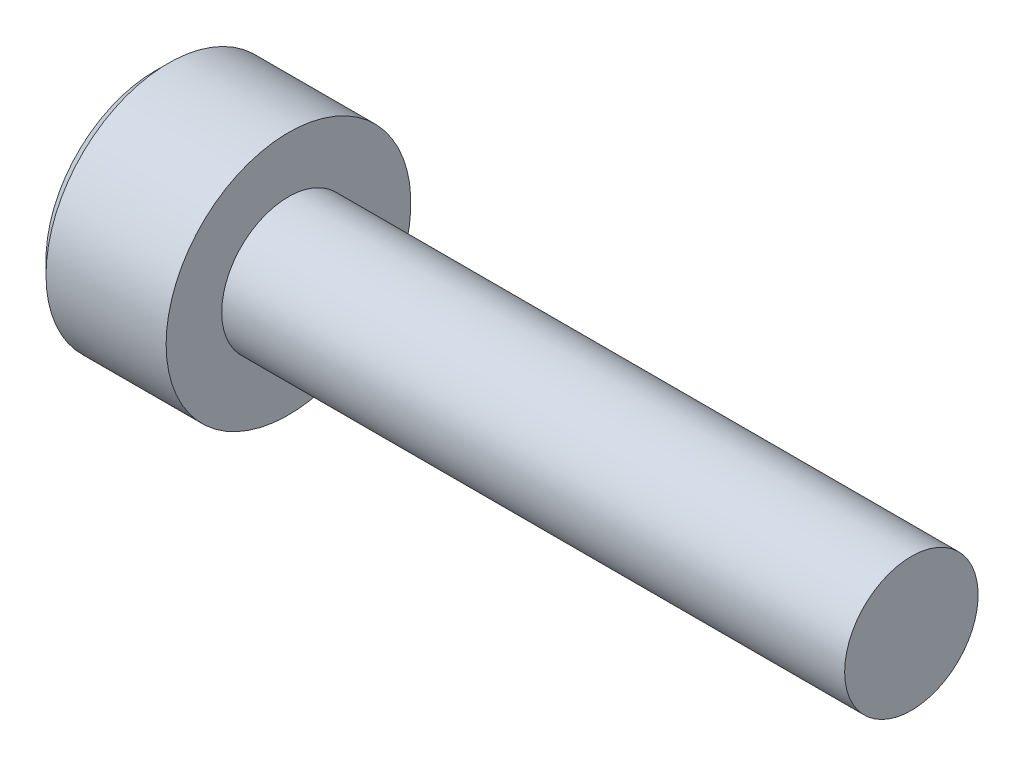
ISO-10303-21;
HEADER;
FILE_DESCRIPTION(('STEP AP214'),'2;1');
FILE_NAME('part.step','',(''),(''),'','','');
FILE_SCHEMA(('AUTOMOTIVE_DESIGN { 1 0 10303 214 1 1 1 1 }'));
ENDSEC;
DATA;
#1=APPLICATION_CONTEXT('core data for automotive mechanical design processes');
#2=APPLICATION_PROTOCOL_DEFINITION('international standard','automotive_design',2000,#1);
#3=PRODUCT_CONTEXT('',#1,'mechanical');
#4=PRODUCT('Part','Part','',(#3));
#5=PRODUCT_RELATED_PRODUCT_CATEGORY('part','',(#4));
#6=PRODUCT_DEFINITION_FORMATION('','',#4);
#7=PRODUCT_DEFINITION_CONTEXT('part definition',#1,'design');
#8=PRODUCT_DEFINITION('design','',#6,#7);
#9=PRODUCT_DEFINITION_SHAPE('','',#8);
#10=(LENGTH_UNIT() NAMED_UNIT(*) SI_UNIT(.MILLI.,.METRE.));
#11=(NAMED_UNIT(*) PLANE_ANGLE_UNIT() SI_UNIT($,.RADIAN.));
#12=(NAMED_UNIT(*) SI_UNIT($,.STERADIAN.) SOLID_ANGLE_UNIT());
#13=UNCERTAINTY_MEASURE_WITH_UNIT(LENGTH_MEASURE(1.E-05),#10,'distance_accuracy_value','');
#14=(GEOMETRIC_REPRESENTATION_CONTEXT(3) GLOBAL_UNCERTAINTY_ASSIGNED_CONTEXT((#13)) GLOBAL_UNIT_ASSIGNED_CONTEXT((#10,
#11,#12)) REPRESENTATION_CONTEXT('',''));
#15=CARTESIAN_POINT('',(0.,0.,0.));
#16=DIRECTION('',(0.,0.,1.));
#17=DIRECTION('',(1.,0.,0.));
#18=AXIS2_PLACEMENT_3D('',#15,#16,#17);
#19=CARTESIAN_POINT('',(-3.,2.75,0.));
#20=DIRECTION('',(1.,0.,0.));
#21=DIRECTION('',(0.,0.,-1.));
#22=AXIS2_PLACEMENT_3D('',#19,#20,#21);
#23=PLANE('',#22);
#24=CARTESIAN_POINT('',(-3.,0.,0.));
#25=DIRECTION('',(1.,0.,0.));
#26=DIRECTION('',(0.,0.,-1.));
#27=AXIS2_PLACEMENT_3D('',#24,#25,#26);
#28=CIRCLE('',#27,2.45);
#29=CARTESIAN_POINT('',(-3.,0.,-2.45));
#30=VERTEX_POINT('',#29);
#31=EDGE_CURVE('E45',#30,#30,#28,.F.);
#32=ORIENTED_EDGE('',*,*,#31,.T.);
#33=EDGE_LOOP('',(#32));
#34=FACE_BOUND('',#33,.T.);
#35=DIRECTION('',(0.,0.5,0.866025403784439));
#36=VECTOR('',#35,1.);
#37=CARTESIAN_POINT('',(-3.,-1.44337567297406,0.));
#38=LINE('',#37,#36);
#39=CARTESIAN_POINT('',(-3.,-1.44337567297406,0.));
#40=VERTEX_POINT('',#39);
#41=CARTESIAN_POINT('',(-3.,-0.721687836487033,1.25));
#42=VERTEX_POINT('',#41);
#43=EDGE_CURVE('E152',#40,#42,#38,.T.);
#44=ORIENTED_EDGE('',*,*,#43,.F.);
#45=DIRECTION('',(0.,-0.5,0.866025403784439));
#46=VECTOR('',#45,1.);
#47=CARTESIAN_POINT('',(-3.,-0.721687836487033,-1.25));
#48=LINE('',#47,#46);
#49=CARTESIAN_POINT('',(-3.,-0.721687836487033,-1.25));
#50=VERTEX_POINT('',#49);
#51=EDGE_CURVE('E52',#50,#40,#48,.T.);
#52=ORIENTED_EDGE('',*,*,#51,.F.);
#53=DIRECTION('',(0.,-1.,0.));
#54=VECTOR('',#53,1.);
#55=CARTESIAN_POINT('',(-3.,0.721687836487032,-1.25));
#56=LINE('',#55,#54);
#57=CARTESIAN_POINT('',(-3.,0.721687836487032,-1.25));
#58=VERTEX_POINT('',#57);
#59=EDGE_CURVE('E122',#58,#50,#56,.T.);
#60=ORIENTED_EDGE('',*,*,#59,.F.);
#61=DIRECTION('',(0.,-0.5,-0.866025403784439));
#62=VECTOR('',#61,1.);
#63=CARTESIAN_POINT('',(-3.,1.44337567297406,0.));
#64=LINE('',#63,#62);
#65=CARTESIAN_POINT('',(-3.,1.44337567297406,0.));
#66=VERTEX_POINT('',#65);
#67=EDGE_CURVE('E158',#66,#58,#64,.T.);
#68=ORIENTED_EDGE('',*,*,#67,.F.);
#69=DIRECTION('',(0.,0.5,-0.866025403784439));
#70=VECTOR('',#69,1.);
#71=CARTESIAN_POINT('',(-3.,0.721687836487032,1.25));
#72=LINE('',#71,#70);
#73=CARTESIAN_POINT('',(-3.,0.721687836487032,1.25));
#74=VERTEX_POINT('',#73);
#75=EDGE_CURVE('E156',#74,#66,#72,.T.);
#76=ORIENTED_EDGE('',*,*,#75,.F.);
#77=DIRECTION('',(0.,1.,0.));
#78=VECTOR('',#77,1.);
#79=CARTESIAN_POINT('',(-3.,-0.721687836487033,1.25));
#80=LINE('',#79,#78);
#81=EDGE_CURVE('E154',#42,#74,#80,.T.);
#82=ORIENTED_EDGE('',*,*,#81,.F.);
#83=EDGE_LOOP('',(#44,#52,#60,#68,#76,#82));
#84=FACE_BOUND('',#83,.T.);
#85=ADVANCED_FACE('F37',(#34,#84),#23,.F.);
#86=CARTESIAN_POINT('',(14.,0.,0.));
#87=DIRECTION('',(-1.,0.,0.));
#88=DIRECTION('',(0.,0.,1.));
#89=AXIS2_PLACEMENT_3D('',#86,#87,#88);
#90=PLANE('',#89);
#91=CARTESIAN_POINT('',(14.,0.,0.));
#92=DIRECTION('',(-1.,0.,0.));
#93=DIRECTION('',(0.,0.,1.));
#94=AXIS2_PLACEMENT_3D('',#91,#92,#93);
#95=CIRCLE('',#94,1.5);
#96=CARTESIAN_POINT('',(14.,0.,1.5));
#97=VERTEX_POINT('',#96);
#98=EDGE_CURVE('E184',#97,#97,#95,.T.);
#99=ORIENTED_EDGE('',*,*,#98,.F.);
#100=EDGE_LOOP('',(#99));
#101=FACE_BOUND('',#100,.T.);
#102=ADVANCED_FACE('F205',(#101),#90,.F.);
#103=CARTESIAN_POINT('',(-3.,0.,0.));
#104=DIRECTION('',(-1.,0.,0.));
#105=DIRECTION('',(0.,0.,1.));
#106=AXIS2_PLACEMENT_3D('',#103,#104,#105);
#107=CYLINDRICAL_SURFACE('',#106,1.5);
#108=CARTESIAN_POINT('',(0.,0.,0.));
#109=DIRECTION('',(-1.,0.,0.));
#110=DIRECTION('',(0.,0.,1.));
#111=AXIS2_PLACEMENT_3D('',#108,#109,#110);
#112=CIRCLE('',#111,1.5);
#113=CARTESIAN_POINT('',(0.,0.,1.5));
#114=VERTEX_POINT('',#113);
#115=EDGE_CURVE('E181',#114,#114,#112,.T.);
#116=ORIENTED_EDGE('',*,*,#115,.F.);
#117=EDGE_LOOP('',(#116));
#118=FACE_BOUND('',#117,.T.);
#119=ORIENTED_EDGE('',*,*,#98,.T.);
#120=EDGE_LOOP('',(#119));
#121=FACE_BOUND('',#120,.T.);
#122=ADVANCED_FACE('F209',(#118,#121),#107,.T.);
#123=CARTESIAN_POINT('',(0.,1.5,0.));
#124=DIRECTION('',(-1.,0.,0.));
#125=DIRECTION('',(0.,0.,1.));
#126=AXIS2_PLACEMENT_3D('',#123,#124,#125);
#127=PLANE('',#126);
#128=CARTESIAN_POINT('',(0.,0.,0.));
#129=DIRECTION('',(-1.,0.,0.));
#130=DIRECTION('',(0.,0.,1.));
#131=AXIS2_PLACEMENT_3D('',#128,#129,#130);
#132=CIRCLE('',#131,2.75);
#133=CARTESIAN_POINT('',(0.,0.,2.75));
#134=VERTEX_POINT('',#133);
#135=EDGE_CURVE('E177',#134,#134,#132,.T.);
#136=ORIENTED_EDGE('',*,*,#135,.F.);
#137=EDGE_LOOP('',(#136));
#138=FACE_BOUND('',#137,.T.);
#139=ORIENTED_EDGE('',*,*,#115,.T.);
#140=EDGE_LOOP('',(#139));
#141=FACE_BOUND('',#140,.T.);
#142=ADVANCED_FACE('F200',(#138,#141),#127,.F.);
#143=CARTESIAN_POINT('',(-3.,0.,0.));
#144=DIRECTION('',(-1.,0.,0.));
#145=DIRECTION('',(0.,0.,1.));
#146=AXIS2_PLACEMENT_3D('',#143,#144,#145);
#147=CYLINDRICAL_SURFACE('',#146,2.75);
#148=CARTESIAN_POINT('',(-2.7,0.,0.));
#149=DIRECTION('',(1.,0.,0.));
#150=DIRECTION('',(0.,0.,-1.));
#151=AXIS2_PLACEMENT_3D('',#148,#149,#150);
#152=CIRCLE('',#151,2.75);
#153=CARTESIAN_POINT('',(-2.7,0.,-2.75));
#154=VERTEX_POINT('',#153);
#155=EDGE_CURVE('E11',#154,#154,#152,.T.);
#156=ORIENTED_EDGE('',*,*,#155,.T.);
#157=EDGE_LOOP('',(#156));
#158=FACE_BOUND('',#157,.T.);
#159=ORIENTED_EDGE('',*,*,#135,.T.);
#160=EDGE_LOOP('',(#159));
#161=FACE_BOUND('',#160,.T.);
#162=ADVANCED_FACE('F192',(#158,#161),#147,.T.);
#163=CARTESIAN_POINT('',(-3.,0.,0.));
#164=DIRECTION('',(1.,0.,0.));
#165=DIRECTION('',(0.,0.,-1.));
#166=AXIS2_PLACEMENT_3D('',#163,#164,#165);
#167=CONICAL_SURFACE('',#166,2.45,0.785398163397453);
#168=ORIENTED_EDGE('',*,*,#155,.F.);
#169=EDGE_LOOP('',(#168));
#170=FACE_BOUND('',#169,.T.);
#171=ORIENTED_EDGE('',*,*,#31,.F.);
#172=EDGE_LOOP('',(#171));
#173=FACE_BOUND('',#172,.T.);
#174=ADVANCED_FACE('F39',(#170,#173),#167,.T.);
#175=CARTESIAN_POINT('',(-1.7,-0.721687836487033,-1.25));
#176=DIRECTION('',(0.,-0.866025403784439,-0.5));
#177=DIRECTION('',(0.,0.5,-0.866025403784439));
#178=AXIS2_PLACEMENT_3D('',#175,#176,#177);
#179=PLANE('',#178);
#180=DIRECTION('',(0.,-0.5,0.866025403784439));
#181=VECTOR('',#180,1.);
#182=CARTESIAN_POINT('',(-1.7,-0.721687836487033,-1.25));
#183=LINE('',#182,#181);
#184=CARTESIAN_POINT('',(-1.7,-0.721687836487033,-1.25));
#185=VERTEX_POINT('',#184);
#186=CARTESIAN_POINT('',(-1.7,-1.08253175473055,-0.625));
#187=VERTEX_POINT('',#186);
#188=EDGE_CURVE('E121',#185,#187,#183,.T.);
#189=ORIENTED_EDGE('',*,*,#188,.F.);
#190=DIRECTION('',(-1.,0.,0.));
#191=VECTOR('',#190,1.);
#192=CARTESIAN_POINT('',(-1.7,-0.721687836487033,-1.25));
#193=LINE('',#192,#191);
#194=EDGE_CURVE('E161',#185,#50,#193,.T.);
#195=ORIENTED_EDGE('',*,*,#194,.T.);
#196=ORIENTED_EDGE('',*,*,#51,.T.);
#197=DIRECTION('',(-1.,0.,0.));
#198=VECTOR('',#197,1.);
#199=CARTESIAN_POINT('',(-1.7,-1.44337567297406,0.));
#200=LINE('',#199,#198);
#201=CARTESIAN_POINT('',(-1.7,-1.44337567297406,0.));
#202=VERTEX_POINT('',#201);
#203=EDGE_CURVE('E124',#202,#40,#200,.T.);
#204=ORIENTED_EDGE('',*,*,#203,.F.);
#205=EDGE_CURVE('E113',#187,#202,#183,.T.);
#206=ORIENTED_EDGE('',*,*,#205,.F.);
#207=EDGE_LOOP('',(#189,#195,#196,#204,#206));
#208=FACE_BOUND('',#207,.T.);
#209=ADVANCED_FACE('F125',(#208),#179,.F.);
#210=CARTESIAN_POINT('',(-1.7,0.721687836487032,-1.25));
#211=DIRECTION('',(0.,0.,-1.));
#212=DIRECTION('',(0.,1.,0.));
#213=AXIS2_PLACEMENT_3D('',#210,#211,#212);
#214=PLANE('',#213);
#215=DIRECTION('',(0.,-1.,0.));
#216=VECTOR('',#215,1.);
#217=CARTESIAN_POINT('',(-1.7,0.721687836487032,-1.25));
#218=LINE('',#217,#216);
#219=CARTESIAN_POINT('',(-1.7,0.721687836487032,-1.25));
#220=VERTEX_POINT('',#219);
#221=CARTESIAN_POINT('',(-1.7,0.,-1.25));
#222=VERTEX_POINT('',#221);
#223=EDGE_CURVE('E130',#220,#222,#218,.T.);
#224=ORIENTED_EDGE('',*,*,#223,.F.);
#225=DIRECTION('',(-1.,0.,0.));
#226=VECTOR('',#225,1.);
#227=CARTESIAN_POINT('',(-1.7,0.721687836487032,-1.25));
#228=LINE('',#227,#226);
#229=EDGE_CURVE('E163',#220,#58,#228,.T.);
#230=ORIENTED_EDGE('',*,*,#229,.T.);
#231=ORIENTED_EDGE('',*,*,#59,.T.);
#232=ORIENTED_EDGE('',*,*,#194,.F.);
#233=EDGE_CURVE('E148',#222,#185,#218,.T.);
#234=ORIENTED_EDGE('',*,*,#233,.F.);
#235=EDGE_LOOP('',(#224,#230,#231,#232,#234));
#236=FACE_BOUND('',#235,.T.);
#237=ADVANCED_FACE('F198',(#236),#214,.F.);
#238=CARTESIAN_POINT('',(-1.7,1.44337567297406,0.));
#239=DIRECTION('',(0.,0.866025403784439,-0.5));
#240=DIRECTION('',(0.,0.5,0.866025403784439));
#241=AXIS2_PLACEMENT_3D('',#238,#239,#240);
#242=PLANE('',#241);
#243=DIRECTION('',(0.,-0.5,-0.866025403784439));
#244=VECTOR('',#243,1.);
#245=CARTESIAN_POINT('',(-1.7,1.44337567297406,0.));
#246=LINE('',#245,#244);
#247=CARTESIAN_POINT('',(-1.7,1.44337567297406,0.));
#248=VERTEX_POINT('',#247);
#249=CARTESIAN_POINT('',(-1.7,1.08253175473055,-0.625));
#250=VERTEX_POINT('',#249);
#251=EDGE_CURVE('E145',#248,#250,#246,.T.);
#252=ORIENTED_EDGE('',*,*,#251,.F.);
#253=DIRECTION('',(-1.,0.,0.));
#254=VECTOR('',#253,1.);
#255=CARTESIAN_POINT('',(-1.7,1.44337567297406,0.));
#256=LINE('',#255,#254);
#257=EDGE_CURVE('E166',#248,#66,#256,.T.);
#258=ORIENTED_EDGE('',*,*,#257,.T.);
#259=ORIENTED_EDGE('',*,*,#67,.T.);
#260=ORIENTED_EDGE('',*,*,#229,.F.);
#261=EDGE_CURVE('E144',#250,#220,#246,.T.);
#262=ORIENTED_EDGE('',*,*,#261,.F.);
#263=EDGE_LOOP('',(#252,#258,#259,#260,#262));
#264=FACE_BOUND('',#263,.T.);
#265=ADVANCED_FACE('F234',(#264),#242,.F.);
#266=CARTESIAN_POINT('',(-1.7,0.721687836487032,1.25));
#267=DIRECTION('',(0.,0.866025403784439,0.5));
#268=DIRECTION('',(0.,-0.5,0.866025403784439));
#269=AXIS2_PLACEMENT_3D('',#266,#267,#268);
#270=PLANE('',#269);
#271=DIRECTION('',(0.,0.5,-0.866025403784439));
#272=VECTOR('',#271,1.);
#273=CARTESIAN_POINT('',(-1.7,0.721687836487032,1.25));
#274=LINE('',#273,#272);
#275=CARTESIAN_POINT('',(-1.7,0.721687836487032,1.25));
#276=VERTEX_POINT('',#275);
#277=CARTESIAN_POINT('',(-1.7,1.08253175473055,0.624999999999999));
#278=VERTEX_POINT('',#277);
#279=EDGE_CURVE('E141',#276,#278,#274,.T.);
#280=ORIENTED_EDGE('',*,*,#279,.F.);
#281=DIRECTION('',(-1.,0.,0.));
#282=VECTOR('',#281,1.);
#283=CARTESIAN_POINT('',(-1.7,0.721687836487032,1.25));
#284=LINE('',#283,#282);
#285=EDGE_CURVE('E169',#276,#74,#284,.T.);
#286=ORIENTED_EDGE('',*,*,#285,.T.);
#287=ORIENTED_EDGE('',*,*,#75,.T.);
#288=ORIENTED_EDGE('',*,*,#257,.F.);
#289=EDGE_CURVE('E140',#278,#248,#274,.T.);
#290=ORIENTED_EDGE('',*,*,#289,.F.);
#291=EDGE_LOOP('',(#280,#286,#287,#288,#290));
#292=FACE_BOUND('',#291,.T.);
#293=ADVANCED_FACE('F230',(#292),#270,.F.);
#294=CARTESIAN_POINT('',(-1.7,-0.721687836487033,1.25));
#295=DIRECTION('',(0.,0.,1.));
#296=DIRECTION('',(1.,0.,0.));
#297=AXIS2_PLACEMENT_3D('',#294,#295,#296);
#298=PLANE('',#297);
#299=DIRECTION('',(0.,1.,0.));
#300=VECTOR('',#299,1.);
#301=CARTESIAN_POINT('',(-1.7,-0.721687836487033,1.25));
#302=LINE('',#301,#300);
#303=CARTESIAN_POINT('',(-1.7,-0.721687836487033,1.25));
#304=VERTEX_POINT('',#303);
#305=CARTESIAN_POINT('',(-1.7,0.,1.25));
#306=VERTEX_POINT('',#305);
#307=EDGE_CURVE('E60',#304,#306,#302,.T.);
#308=ORIENTED_EDGE('',*,*,#307,.F.);
#309=DIRECTION('',(-1.,0.,0.));
#310=VECTOR('',#309,1.);
#311=CARTESIAN_POINT('',(-1.7,-0.721687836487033,1.25));
#312=LINE('',#311,#310);
#313=EDGE_CURVE('E129',#304,#42,#312,.T.);
#314=ORIENTED_EDGE('',*,*,#313,.T.);
#315=ORIENTED_EDGE('',*,*,#81,.T.);
#316=ORIENTED_EDGE('',*,*,#285,.F.);
#317=EDGE_CURVE('E136',#306,#276,#302,.T.);
#318=ORIENTED_EDGE('',*,*,#317,.F.);
#319=EDGE_LOOP('',(#308,#314,#315,#316,#318));
#320=FACE_BOUND('',#319,.T.);
#321=ADVANCED_FACE('F227',(#320),#298,.F.);
#322=CARTESIAN_POINT('',(-1.7,-1.44337567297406,0.));
#323=DIRECTION('',(0.,-0.866025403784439,0.5));
#324=DIRECTION('',(0.,-0.5,-0.866025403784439));
#325=AXIS2_PLACEMENT_3D('',#322,#323,#324);
#326=PLANE('',#325);
#327=DIRECTION('',(0.,0.5,0.866025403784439));
#328=VECTOR('',#327,1.);
#329=CARTESIAN_POINT('',(-1.7,-1.44337567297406,0.));
#330=LINE('',#329,#328);
#331=CARTESIAN_POINT('',(-1.7,-1.08253175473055,0.625));
#332=VERTEX_POINT('',#331);
#333=EDGE_CURVE('E116',#202,#332,#330,.T.);
#334=ORIENTED_EDGE('',*,*,#333,.F.);
#335=ORIENTED_EDGE('',*,*,#203,.T.);
#336=ORIENTED_EDGE('',*,*,#43,.T.);
#337=ORIENTED_EDGE('',*,*,#313,.F.);
#338=EDGE_CURVE('E135',#332,#304,#330,.T.);
#339=ORIENTED_EDGE('',*,*,#338,.F.);
#340=EDGE_LOOP('',(#334,#335,#336,#337,#339));
#341=FACE_BOUND('',#340,.T.);
#342=ADVANCED_FACE('F133',(#341),#326,.F.);
#343=CARTESIAN_POINT('',(-1.7,0.,0.));
#344=DIRECTION('',(-1.,0.,0.));
#345=DIRECTION('',(0.,0.,1.));
#346=AXIS2_PLACEMENT_3D('',#343,#344,#345);
#347=PLANE('',#346);
#348=ORIENTED_EDGE('',*,*,#317,.T.);
#349=ORIENTED_EDGE('',*,*,#279,.T.);
#350=CARTESIAN_POINT('',(-1.7,0.,0.));
#351=DIRECTION('',(-1.,0.,0.));
#352=DIRECTION('',(0.,-1.,0.));
#353=AXIS2_PLACEMENT_3D('',#350,#351,#352);
#354=CIRCLE('',#353,1.25);
#355=EDGE_CURVE('E178',#306,#278,#354,.T.);
#356=ORIENTED_EDGE('',*,*,#355,.F.);
#357=EDGE_LOOP('',(#348,#349,#356));
#358=FACE_BOUND('',#357,.T.);
#359=ADVANCED_FACE('F226',(#358),#347,.T.);
#360=ORIENTED_EDGE('',*,*,#289,.T.);
#361=ORIENTED_EDGE('',*,*,#251,.T.);
#362=EDGE_CURVE('E264',#278,#250,#354,.T.);
#363=ORIENTED_EDGE('',*,*,#362,.F.);
#364=EDGE_LOOP('',(#360,#361,#363));
#365=FACE_BOUND('',#364,.T.);
#366=ADVANCED_FACE('F248',(#365),#347,.T.);
#367=ORIENTED_EDGE('',*,*,#261,.T.);
#368=ORIENTED_EDGE('',*,*,#223,.T.);
#369=EDGE_CURVE('E266',#250,#222,#354,.T.);
#370=ORIENTED_EDGE('',*,*,#369,.F.);
#371=EDGE_LOOP('',(#367,#368,#370));
#372=FACE_BOUND('',#371,.T.);
#373=ADVANCED_FACE('F253',(#372),#347,.T.);
#374=ORIENTED_EDGE('',*,*,#233,.T.);
#375=ORIENTED_EDGE('',*,*,#188,.T.);
#376=EDGE_CURVE('E267',#222,#187,#354,.T.);
#377=ORIENTED_EDGE('',*,*,#376,.F.);
#378=EDGE_LOOP('',(#374,#375,#377));
#379=FACE_BOUND('',#378,.T.);
#380=ADVANCED_FACE('F246',(#379),#347,.T.);
#381=ORIENTED_EDGE('',*,*,#205,.T.);
#382=ORIENTED_EDGE('',*,*,#333,.T.);
#383=EDGE_CURVE('E118',#187,#332,#354,.T.);
#384=ORIENTED_EDGE('',*,*,#383,.F.);
#385=EDGE_LOOP('',(#381,#382,#384));
#386=FACE_BOUND('',#385,.T.);
#387=ADVANCED_FACE('F114',(#386),#347,.T.);
#388=ORIENTED_EDGE('',*,*,#338,.T.);
#389=ORIENTED_EDGE('',*,*,#307,.T.);
#390=EDGE_CURVE('E174',#332,#306,#354,.T.);
#391=ORIENTED_EDGE('',*,*,#390,.F.);
#392=EDGE_LOOP('',(#388,#389,#391));
#393=FACE_BOUND('',#392,.T.);
#394=ADVANCED_FACE('F221',(#393),#347,.T.);
#395=CARTESIAN_POINT('',(-0.948924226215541,0.,0.));
#396=DIRECTION('',(-1.,0.,0.));
#397=DIRECTION('',(0.,-1.,0.));
#398=AXIS2_PLACEMENT_3D('',#395,#396,#397);
#399=CONICAL_SURFACE('',#398,0.,1.02974425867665);
#400=ORIENTED_EDGE('',*,*,#390,.T.);
#401=ORIENTED_EDGE('',*,*,#355,.T.);
#402=ORIENTED_EDGE('',*,*,#362,.T.);
#403=ORIENTED_EDGE('',*,*,#369,.T.);
#404=ORIENTED_EDGE('',*,*,#376,.T.);
#405=ORIENTED_EDGE('',*,*,#383,.T.);
#406=EDGE_LOOP('',(#400,#401,#402,#403,#404,#405));
#407=FACE_BOUND('',#406,.T.);
#408=CARTESIAN_POINT('',(-0.948924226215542,0.,0.));
#409=VERTEX_POINT('',#408);
#410=VERTEX_LOOP('',#409);
#411=FACE_BOUND('',#410,.T.);
#412=ADVANCED_FACE('F219',(#407,#411),#399,.F.);
#413=CLOSED_SHELL('',(#85,#102,#122,#142,#162,#174,#209,#237,#265,#293,#321,#342,#359,#366,#373,
#380,#387,#394,#412));
#414=MANIFOLD_SOLID_BREP('B2',#413);
#415=ADVANCED_BREP_SHAPE_REPRESENTATION('',(#18,#414),#14);
#416=SHAPE_DEFINITION_REPRESENTATION(#9,#415);
ENDSEC;
END-ISO-10303-21;
